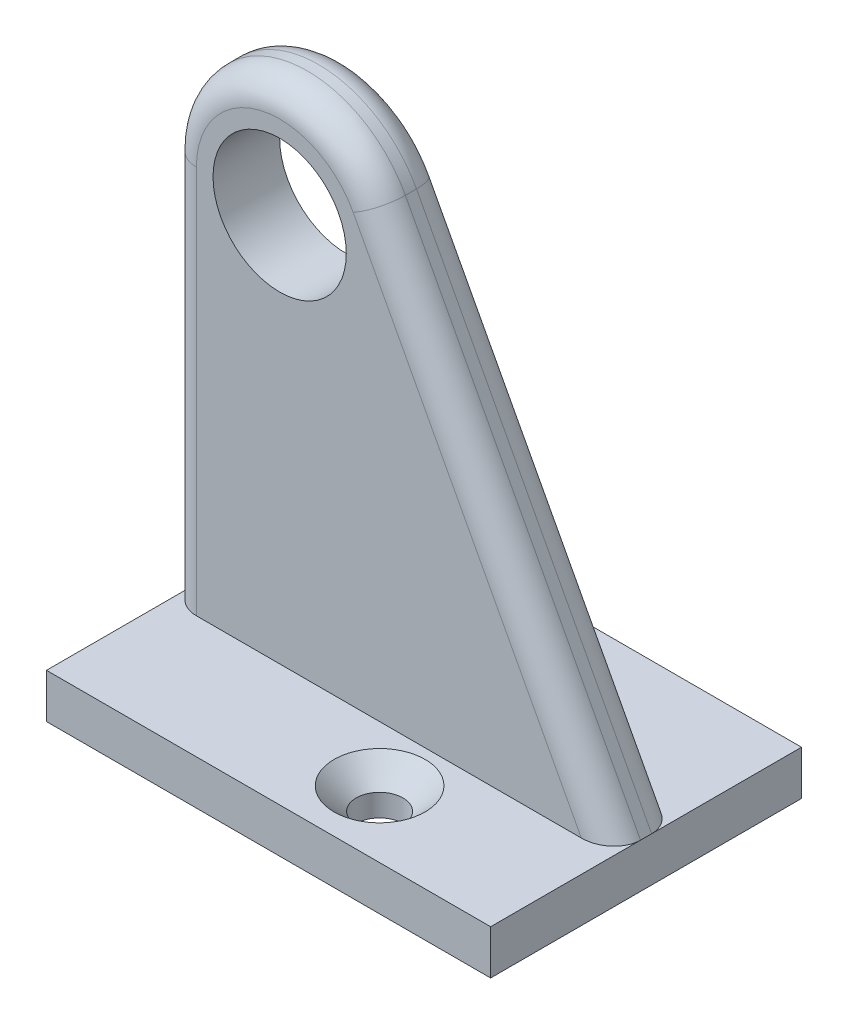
ISO-10303-21;
HEADER;
FILE_DESCRIPTION(('STEP AP214'),'2;1');
FILE_NAME('part.step','',(''),(''),'','','');
FILE_SCHEMA(('AUTOMOTIVE_DESIGN { 1 0 10303 214 1 1 1 1 }'));
ENDSEC;
DATA;
#1=APPLICATION_CONTEXT('core data for automotive mechanical design processes');
#2=APPLICATION_PROTOCOL_DEFINITION('international standard','automotive_design',2000,#1);
#3=PRODUCT_CONTEXT('',#1,'mechanical');
#4=PRODUCT('Part','Part','',(#3));
#5=PRODUCT_RELATED_PRODUCT_CATEGORY('part','',(#4));
#6=PRODUCT_DEFINITION_FORMATION('','',#4);
#7=PRODUCT_DEFINITION_CONTEXT('part definition',#1,'design');
#8=PRODUCT_DEFINITION('design','',#6,#7);
#9=PRODUCT_DEFINITION_SHAPE('','',#8);
#10=(LENGTH_UNIT() NAMED_UNIT(*) SI_UNIT(.MILLI.,.METRE.));
#11=(NAMED_UNIT(*) PLANE_ANGLE_UNIT() SI_UNIT($,.RADIAN.));
#12=(NAMED_UNIT(*) SI_UNIT($,.STERADIAN.) SOLID_ANGLE_UNIT());
#13=UNCERTAINTY_MEASURE_WITH_UNIT(LENGTH_MEASURE(1.E-05),#10,'distance_accuracy_value','');
#14=(GEOMETRIC_REPRESENTATION_CONTEXT(3) GLOBAL_UNCERTAINTY_ASSIGNED_CONTEXT((#13)) GLOBAL_UNIT_ASSIGNED_CONTEXT((#10,
#11,#12)) REPRESENTATION_CONTEXT('',''));
#15=CARTESIAN_POINT('',(0.,0.,0.));
#16=DIRECTION('',(0.,0.,1.));
#17=DIRECTION('',(1.,0.,0.));
#18=AXIS2_PLACEMENT_3D('',#15,#16,#17);
#19=CARTESIAN_POINT('',(-10.,35.,-3.));
#20=DIRECTION('',(0.,0.,1.));
#21=DIRECTION('',(1.,0.,0.));
#22=AXIS2_PLACEMENT_3D('',#19,#20,#21);
#23=PLANE('',#22);
#24=CARTESIAN_POINT('',(-10.,35.,-3.));
#25=DIRECTION('',(0.,0.,-1.));
#26=DIRECTION('',(-1.,0.,0.));
#27=AXIS2_PLACEMENT_3D('',#24,#25,#26);
#28=CIRCLE('',#27,5.99999999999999);
#29=CARTESIAN_POINT('',(-16.,35.,-3.));
#30=VERTEX_POINT('',#29);
#31=EDGE_CURVE('E193',#30,#30,#28,.T.);
#32=ORIENTED_EDGE('',*,*,#31,.F.);
#33=EDGE_LOOP('',(#32));
#34=FACE_BOUND('',#33,.T.);
#35=DIRECTION('',(1.,0.,0.));
#36=VECTOR('',#35,1.);
#37=CARTESIAN_POINT('',(20.,0.,-3.));
#38=LINE('',#37,#36);
#39=CARTESIAN_POINT('',(-17.5,0.,-3.));
#40=VERTEX_POINT('',#39);
#41=CARTESIAN_POINT('',(17.1666666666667,0.,-3.));
#42=VERTEX_POINT('',#41);
#43=EDGE_CURVE('E147',#40,#42,#38,.T.);
#44=ORIENTED_EDGE('',*,*,#43,.F.);
#45=DIRECTION('',(0.,-1.,0.));
#46=VECTOR('',#45,1.);
#47=CARTESIAN_POINT('',(-17.5,35.,-3.));
#48=LINE('',#47,#46);
#49=CARTESIAN_POINT('',(-17.5,35.,-3.));
#50=VERTEX_POINT('',#49);
#51=EDGE_CURVE('E200',#40,#50,#48,.F.);
#52=ORIENTED_EDGE('',*,*,#51,.T.);
#53=CARTESIAN_POINT('',(-10.,35.,-3.));
#54=DIRECTION('',(0.,0.,1.));
#55=DIRECTION('',(1.,0.,0.));
#56=AXIS2_PLACEMENT_3D('',#53,#54,#55);
#57=CIRCLE('',#56,7.5);
#58=CARTESIAN_POINT('',(-3.38235294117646,38.5294117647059,-3.));
#59=VERTEX_POINT('',#58);
#60=EDGE_CURVE('E198',#50,#59,#57,.F.);
#61=ORIENTED_EDGE('',*,*,#60,.T.);
#62=DIRECTION('',(-0.470588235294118,0.882352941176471,0.));
#63=VECTOR('',#62,1.);
#64=CARTESIAN_POINT('',(17.7941176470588,-1.17647058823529,-3.));
#65=LINE('',#64,#63);
#66=EDGE_CURVE('E196',#59,#42,#65,.F.);
#67=ORIENTED_EDGE('',*,*,#66,.T.);
#68=EDGE_LOOP('',(#44,#52,#61,#67));
#69=FACE_BOUND('',#68,.T.);
#70=ADVANCED_FACE('F35',(#34,#69),#23,.F.);
#71=CARTESIAN_POINT('',(-10.,35.,-3.));
#72=DIRECTION('',(0.,0.,1.));
#73=DIRECTION('',(1.,0.,0.));
#74=AXIS2_PLACEMENT_3D('',#71,#72,#73);
#75=CYLINDRICAL_SURFACE('',#74,10.);
#76=DIRECTION('',(0.,0.,1.));
#77=VECTOR('',#76,1.);
#78=CARTESIAN_POINT('',(-1.17647058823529,39.7058823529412,-3.));
#79=LINE('',#78,#77);
#80=CARTESIAN_POINT('',(-1.17647058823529,39.7058823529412,-0.499999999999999));
#81=VERTEX_POINT('',#80);
#82=CARTESIAN_POINT('',(-1.17647058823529,39.7058823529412,0.5));
#83=VERTEX_POINT('',#82);
#84=EDGE_CURVE('E177',#81,#83,#79,.T.);
#85=ORIENTED_EDGE('',*,*,#84,.F.);
#86=CARTESIAN_POINT('',(-10.,35.,-0.499999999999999));
#87=DIRECTION('',(0.,0.,1.));
#88=DIRECTION('',(1.,0.,0.));
#89=AXIS2_PLACEMENT_3D('',#86,#87,#88);
#90=CIRCLE('',#89,10.);
#91=CARTESIAN_POINT('',(-20.,35.,-0.499999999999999));
#92=VERTEX_POINT('',#91);
#93=EDGE_CURVE('E204',#81,#92,#90,.T.);
#94=ORIENTED_EDGE('',*,*,#93,.T.);
#95=DIRECTION('',(0.,0.,1.));
#96=VECTOR('',#95,1.);
#97=CARTESIAN_POINT('',(-20.,35.,-3.));
#98=LINE('',#97,#96);
#99=CARTESIAN_POINT('',(-20.,35.,0.5));
#100=VERTEX_POINT('',#99);
#101=EDGE_CURVE('E176',#92,#100,#98,.T.);
#102=ORIENTED_EDGE('',*,*,#101,.T.);
#103=CARTESIAN_POINT('',(-10.,35.,0.5));
#104=DIRECTION('',(0.,0.,1.));
#105=DIRECTION('',(1.,0.,0.));
#106=AXIS2_PLACEMENT_3D('',#103,#104,#105);
#107=CIRCLE('',#106,10.);
#108=EDGE_CURVE('E202',#100,#83,#107,.F.);
#109=ORIENTED_EDGE('',*,*,#108,.T.);
#110=EDGE_LOOP('',(#85,#94,#102,#109));
#111=FACE_BOUND('',#110,.T.);
#112=ADVANCED_FACE('F258',(#111),#75,.T.);
#113=CARTESIAN_POINT('',(20.,0.,-3.));
#114=DIRECTION('',(0.882352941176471,0.470588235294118,0.));
#115=DIRECTION('',(-0.470588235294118,0.882352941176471,0.));
#116=AXIS2_PLACEMENT_3D('',#113,#114,#115);
#117=PLANE('',#116);
#118=DIRECTION('',(0.,0.,1.));
#119=VECTOR('',#118,1.);
#120=CARTESIAN_POINT('',(20.,0.,-3.));
#121=LINE('',#120,#119);
#122=CARTESIAN_POINT('',(20.,0.,-0.499999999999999));
#123=VERTEX_POINT('',#122);
#124=CARTESIAN_POINT('',(20.,0.,0.5));
#125=VERTEX_POINT('',#124);
#126=EDGE_CURVE('E182',#123,#125,#121,.T.);
#127=ORIENTED_EDGE('',*,*,#126,.F.);
#128=DIRECTION('',(-0.470588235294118,0.882352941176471,0.));
#129=VECTOR('',#128,1.);
#130=CARTESIAN_POINT('',(-1.17647058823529,39.7058823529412,-0.499999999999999));
#131=LINE('',#130,#129);
#132=EDGE_CURVE('E209',#123,#81,#131,.T.);
#133=ORIENTED_EDGE('',*,*,#132,.T.);
#134=ORIENTED_EDGE('',*,*,#84,.T.);
#135=DIRECTION('',(-0.470588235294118,0.882352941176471,0.));
#136=VECTOR('',#135,1.);
#137=CARTESIAN_POINT('',(20.,0.,0.5));
#138=LINE('',#137,#136);
#139=EDGE_CURVE('E206',#83,#125,#138,.F.);
#140=ORIENTED_EDGE('',*,*,#139,.T.);
#141=EDGE_LOOP('',(#127,#133,#134,#140));
#142=FACE_BOUND('',#141,.T.);
#143=ADVANCED_FACE('F245',(#142),#117,.T.);
#144=CARTESIAN_POINT('',(20.,-4.,-3.));
#145=DIRECTION('',(1.,0.,0.));
#146=DIRECTION('',(0.,0.,-1.));
#147=AXIS2_PLACEMENT_3D('',#144,#145,#146);
#148=PLANE('',#147);
#149=CARTESIAN_POINT('',(20.,0.,-14.));
#150=VERTEX_POINT('',#149);
#151=EDGE_CURVE('E134',#150,#123,#121,.T.);
#152=ORIENTED_EDGE('',*,*,#151,.T.);
#153=ORIENTED_EDGE('',*,*,#126,.T.);
#154=DIRECTION('',(0.,0.,-1.));
#155=VECTOR('',#154,1.);
#156=CARTESIAN_POINT('',(20.,0.,14.));
#157=LINE('',#156,#155);
#158=CARTESIAN_POINT('',(20.,0.,14.));
#159=VERTEX_POINT('',#158);
#160=EDGE_CURVE('E174',#159,#125,#157,.T.);
#161=ORIENTED_EDGE('',*,*,#160,.F.);
#162=DIRECTION('',(0.,1.,0.));
#163=VECTOR('',#162,1.);
#164=CARTESIAN_POINT('',(20.,0.,14.));
#165=LINE('',#164,#163);
#166=CARTESIAN_POINT('',(20.,-4.,14.));
#167=VERTEX_POINT('',#166);
#168=EDGE_CURVE('E157',#167,#159,#165,.T.);
#169=ORIENTED_EDGE('',*,*,#168,.F.);
#170=DIRECTION('',(0.,0.,1.));
#171=VECTOR('',#170,1.);
#172=CARTESIAN_POINT('',(20.,-4.,-3.));
#173=LINE('',#172,#171);
#174=CARTESIAN_POINT('',(20.,-4.,-14.));
#175=VERTEX_POINT('',#174);
#176=EDGE_CURVE('E183',#175,#167,#173,.T.);
#177=ORIENTED_EDGE('',*,*,#176,.F.);
#178=DIRECTION('',(0.,-1.,0.));
#179=VECTOR('',#178,1.);
#180=CARTESIAN_POINT('',(20.,-4.,-14.));
#181=LINE('',#180,#179);
#182=EDGE_CURVE('E138',#150,#175,#181,.T.);
#183=ORIENTED_EDGE('',*,*,#182,.F.);
#184=EDGE_LOOP('',(#152,#153,#161,#169,#177,#183));
#185=FACE_BOUND('',#184,.T.);
#186=ADVANCED_FACE('F248',(#185),#148,.T.);
#187=CARTESIAN_POINT('',(-20.,-4.,-3.));
#188=DIRECTION('',(0.,-1.,0.));
#189=DIRECTION('',(0.,0.,-1.));
#190=AXIS2_PLACEMENT_3D('',#187,#188,#189);
#191=PLANE('',#190);
#192=CARTESIAN_POINT('',(-14.,-4.,-8.));
#193=DIRECTION('',(0.,1.,0.));
#194=DIRECTION('',(0.,0.,1.));
#195=AXIS2_PLACEMENT_3D('',#192,#193,#194);
#196=CIRCLE('',#195,2.1);
#197=CARTESIAN_POINT('',(-14.,-4.,-5.9));
#198=VERTEX_POINT('',#197);
#199=EDGE_CURVE('E499',#198,#198,#196,.T.);
#200=ORIENTED_EDGE('',*,*,#199,.T.);
#201=EDGE_LOOP('',(#200));
#202=FACE_BOUND('',#201,.T.);
#203=CARTESIAN_POINT('',(3.99999999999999,-4.,8.));
#204=DIRECTION('',(0.,1.,0.));
#205=DIRECTION('',(0.,0.,1.));
#206=AXIS2_PLACEMENT_3D('',#203,#204,#205);
#207=CIRCLE('',#206,2.1);
#208=CARTESIAN_POINT('',(3.99999999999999,-4.,10.1));
#209=VERTEX_POINT('',#208);
#210=EDGE_CURVE('E269',#209,#209,#207,.T.);
#211=ORIENTED_EDGE('',*,*,#210,.T.);
#212=EDGE_LOOP('',(#211));
#213=FACE_BOUND('',#212,.T.);
#214=ORIENTED_EDGE('',*,*,#176,.T.);
#215=DIRECTION('',(1.,0.,0.));
#216=VECTOR('',#215,1.);
#217=CARTESIAN_POINT('',(20.,-4.,14.));
#218=LINE('',#217,#216);
#219=CARTESIAN_POINT('',(-20.,-4.,14.));
#220=VERTEX_POINT('',#219);
#221=EDGE_CURVE('E169',#220,#167,#218,.T.);
#222=ORIENTED_EDGE('',*,*,#221,.F.);
#223=DIRECTION('',(0.,0.,1.));
#224=VECTOR('',#223,1.);
#225=CARTESIAN_POINT('',(-20.,-4.,-3.));
#226=LINE('',#225,#224);
#227=CARTESIAN_POINT('',(-20.,-4.,-14.));
#228=VERTEX_POINT('',#227);
#229=EDGE_CURVE('E185',#228,#220,#226,.T.);
#230=ORIENTED_EDGE('',*,*,#229,.F.);
#231=DIRECTION('',(-1.,0.,0.));
#232=VECTOR('',#231,1.);
#233=CARTESIAN_POINT('',(-20.,-4.,-14.));
#234=LINE('',#233,#232);
#235=EDGE_CURVE('E145',#175,#228,#234,.T.);
#236=ORIENTED_EDGE('',*,*,#235,.F.);
#237=EDGE_LOOP('',(#214,#222,#230,#236));
#238=FACE_BOUND('',#237,.T.);
#239=ADVANCED_FACE('F281',(#202,#213,#238),#191,.T.);
#240=CARTESIAN_POINT('',(-20.,35.,-3.));
#241=DIRECTION('',(-1.,0.,0.));
#242=DIRECTION('',(0.,0.,1.));
#243=AXIS2_PLACEMENT_3D('',#240,#241,#242);
#244=PLANE('',#243);
#245=ORIENTED_EDGE('',*,*,#101,.F.);
#246=DIRECTION('',(0.,-1.,0.));
#247=VECTOR('',#246,1.);
#248=CARTESIAN_POINT('',(-20.,0.,-0.499999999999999));
#249=LINE('',#248,#247);
#250=CARTESIAN_POINT('',(-20.,0.,-0.499999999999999));
#251=VERTEX_POINT('',#250);
#252=EDGE_CURVE('E153',#92,#251,#249,.T.);
#253=ORIENTED_EDGE('',*,*,#252,.T.);
#254=DIRECTION('',(0.,0.,1.));
#255=VECTOR('',#254,1.);
#256=CARTESIAN_POINT('',(-20.,0.,-14.));
#257=LINE('',#256,#255);
#258=CARTESIAN_POINT('',(-20.,0.,-14.));
#259=VERTEX_POINT('',#258);
#260=EDGE_CURVE('E131',#259,#251,#257,.T.);
#261=ORIENTED_EDGE('',*,*,#260,.F.);
#262=DIRECTION('',(0.,1.,0.));
#263=VECTOR('',#262,1.);
#264=CARTESIAN_POINT('',(-20.,0.,-14.));
#265=LINE('',#264,#263);
#266=EDGE_CURVE('E139',#228,#259,#265,.T.);
#267=ORIENTED_EDGE('',*,*,#266,.F.);
#268=ORIENTED_EDGE('',*,*,#229,.T.);
#269=DIRECTION('',(0.,-1.,0.));
#270=VECTOR('',#269,1.);
#271=CARTESIAN_POINT('',(-20.,-4.,14.));
#272=LINE('',#271,#270);
#273=CARTESIAN_POINT('',(-20.,0.,14.));
#274=VERTEX_POINT('',#273);
#275=EDGE_CURVE('E166',#274,#220,#272,.T.);
#276=ORIENTED_EDGE('',*,*,#275,.F.);
#277=DIRECTION('',(0.,0.,-1.));
#278=VECTOR('',#277,1.);
#279=CARTESIAN_POINT('',(-20.,0.,14.));
#280=LINE('',#279,#278);
#281=CARTESIAN_POINT('',(-20.,0.,0.5));
#282=VERTEX_POINT('',#281);
#283=EDGE_CURVE('E171',#274,#282,#280,.T.);
#284=ORIENTED_EDGE('',*,*,#283,.T.);
#285=DIRECTION('',(0.,-1.,0.));
#286=VECTOR('',#285,1.);
#287=CARTESIAN_POINT('',(-20.,35.,0.5));
#288=LINE('',#287,#286);
#289=EDGE_CURVE('E180',#282,#100,#288,.F.);
#290=ORIENTED_EDGE('',*,*,#289,.T.);
#291=EDGE_LOOP('',(#245,#253,#261,#267,#268,#276,#284,#290));
#292=FACE_BOUND('',#291,.T.);
#293=ADVANCED_FACE('F151',(#292),#244,.T.);
#294=CARTESIAN_POINT('',(-10.,35.,3.));
#295=DIRECTION('',(0.,0.,1.));
#296=DIRECTION('',(1.,0.,0.));
#297=AXIS2_PLACEMENT_3D('',#294,#295,#296);
#298=PLANE('',#297);
#299=CARTESIAN_POINT('',(-10.,35.,3.));
#300=DIRECTION('',(0.,0.,1.));
#301=DIRECTION('',(1.,0.,0.));
#302=AXIS2_PLACEMENT_3D('',#299,#300,#301);
#303=CIRCLE('',#302,5.99999999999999);
#304=CARTESIAN_POINT('',(-4.00000000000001,35.,3.));
#305=VERTEX_POINT('',#304);
#306=EDGE_CURVE('E189',#305,#305,#303,.T.);
#307=ORIENTED_EDGE('',*,*,#306,.F.);
#308=EDGE_LOOP('',(#307));
#309=FACE_BOUND('',#308,.T.);
#310=DIRECTION('',(-1.,0.,0.));
#311=VECTOR('',#310,1.);
#312=CARTESIAN_POINT('',(-20.,0.,3.));
#313=LINE('',#312,#311);
#314=CARTESIAN_POINT('',(17.1666666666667,0.,3.));
#315=VERTEX_POINT('',#314);
#316=CARTESIAN_POINT('',(-17.5,0.,3.));
#317=VERTEX_POINT('',#316);
#318=EDGE_CURVE('E154',#315,#317,#313,.T.);
#319=ORIENTED_EDGE('',*,*,#318,.F.);
#320=DIRECTION('',(-0.470588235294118,0.882352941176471,0.));
#321=VECTOR('',#320,1.);
#322=CARTESIAN_POINT('',(-3.38235294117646,38.5294117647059,3.));
#323=LINE('',#322,#321);
#324=CARTESIAN_POINT('',(-3.38235294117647,38.5294117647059,3.));
#325=VERTEX_POINT('',#324);
#326=EDGE_CURVE('E214',#315,#325,#323,.T.);
#327=ORIENTED_EDGE('',*,*,#326,.T.);
#328=CARTESIAN_POINT('',(-10.,35.,3.));
#329=DIRECTION('',(0.,0.,1.));
#330=DIRECTION('',(1.,0.,0.));
#331=AXIS2_PLACEMENT_3D('',#328,#329,#330);
#332=CIRCLE('',#331,7.5);
#333=CARTESIAN_POINT('',(-17.5,35.,3.));
#334=VERTEX_POINT('',#333);
#335=EDGE_CURVE('E59',#325,#334,#332,.T.);
#336=ORIENTED_EDGE('',*,*,#335,.T.);
#337=DIRECTION('',(0.,-1.,0.));
#338=VECTOR('',#337,1.);
#339=CARTESIAN_POINT('',(-17.5,35.,3.));
#340=LINE('',#339,#338);
#341=EDGE_CURVE('E211',#334,#317,#340,.T.);
#342=ORIENTED_EDGE('',*,*,#341,.T.);
#343=EDGE_LOOP('',(#319,#327,#336,#342));
#344=FACE_BOUND('',#343,.T.);
#345=ADVANCED_FACE('F235',(#309,#344),#298,.T.);
#346=CARTESIAN_POINT('',(-20.,0.,14.));
#347=DIRECTION('',(0.,-1.,0.));
#348=DIRECTION('',(0.,0.,-1.));
#349=AXIS2_PLACEMENT_3D('',#346,#347,#348);
#350=PLANE('',#349);
#351=CARTESIAN_POINT('',(3.99999999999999,0.,8.));
#352=DIRECTION('',(0.,1.,0.));
#353=DIRECTION('',(0.,0.,1.));
#354=AXIS2_PLACEMENT_3D('',#351,#352,#353);
#355=CIRCLE('',#354,4.1);
#356=CARTESIAN_POINT('',(3.99999999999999,0.,12.1));
#357=VERTEX_POINT('',#356);
#358=EDGE_CURVE('E276',#357,#357,#355,.T.);
#359=ORIENTED_EDGE('',*,*,#358,.F.);
#360=EDGE_LOOP('',(#359));
#361=FACE_BOUND('',#360,.T.);
#362=ORIENTED_EDGE('',*,*,#160,.T.);
#363=CARTESIAN_POINT('',(17.1666666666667,0.,0.5));
#364=DIRECTION('',(0.,-1.,0.));
#365=DIRECTION('',(-1.,0.,0.));
#366=AXIS2_PLACEMENT_3D('',#363,#364,#365);
#367=ELLIPSE('',#366,2.83333333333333,2.5);
#368=EDGE_CURVE('E44',#125,#315,#367,.T.);
#369=ORIENTED_EDGE('',*,*,#368,.T.);
#370=ORIENTED_EDGE('',*,*,#318,.T.);
#371=CARTESIAN_POINT('',(-17.5,0.,0.5));
#372=DIRECTION('',(0.,-1.,0.));
#373=DIRECTION('',(0.,0.,-1.));
#374=AXIS2_PLACEMENT_3D('',#371,#372,#373);
#375=CIRCLE('',#374,2.5);
#376=EDGE_CURVE('E11',#317,#282,#375,.T.);
#377=ORIENTED_EDGE('',*,*,#376,.T.);
#378=ORIENTED_EDGE('',*,*,#283,.F.);
#379=DIRECTION('',(-1.,0.,0.));
#380=VECTOR('',#379,1.);
#381=CARTESIAN_POINT('',(-20.,0.,14.));
#382=LINE('',#381,#380);
#383=EDGE_CURVE('E164',#159,#274,#382,.T.);
#384=ORIENTED_EDGE('',*,*,#383,.F.);
#385=EDGE_LOOP('',(#362,#369,#370,#377,#378,#384));
#386=FACE_BOUND('',#385,.T.);
#387=ADVANCED_FACE('F237',(#361,#386),#350,.F.);
#388=CARTESIAN_POINT('',(0.,0.,14.));
#389=DIRECTION('',(0.,0.,-1.));
#390=DIRECTION('',(-1.,0.,0.));
#391=AXIS2_PLACEMENT_3D('',#388,#389,#390);
#392=PLANE('',#391);
#393=ORIENTED_EDGE('',*,*,#168,.T.);
#394=ORIENTED_EDGE('',*,*,#383,.T.);
#395=ORIENTED_EDGE('',*,*,#275,.T.);
#396=ORIENTED_EDGE('',*,*,#221,.T.);
#397=EDGE_LOOP('',(#393,#394,#395,#396));
#398=FACE_BOUND('',#397,.T.);
#399=ADVANCED_FACE('F285',(#398),#392,.F.);
#400=CARTESIAN_POINT('',(20.,0.,-14.));
#401=DIRECTION('',(0.,-1.,0.));
#402=DIRECTION('',(0.,0.,-1.));
#403=AXIS2_PLACEMENT_3D('',#400,#401,#402);
#404=PLANE('',#403);
#405=CARTESIAN_POINT('',(-14.,0.,-8.));
#406=DIRECTION('',(0.,1.,0.));
#407=DIRECTION('',(0.,0.,1.));
#408=AXIS2_PLACEMENT_3D('',#405,#406,#407);
#409=CIRCLE('',#408,4.1);
#410=CARTESIAN_POINT('',(-14.,0.,-3.9));
#411=VERTEX_POINT('',#410);
#412=EDGE_CURVE('E192',#411,#411,#409,.T.);
#413=ORIENTED_EDGE('',*,*,#412,.F.);
#414=EDGE_LOOP('',(#413));
#415=FACE_BOUND('',#414,.T.);
#416=ORIENTED_EDGE('',*,*,#260,.T.);
#417=CARTESIAN_POINT('',(-17.5,0.,-0.499999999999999));
#418=DIRECTION('',(0.,-1.,0.));
#419=DIRECTION('',(0.,0.,-1.));
#420=AXIS2_PLACEMENT_3D('',#417,#418,#419);
#421=CIRCLE('',#420,2.5);
#422=EDGE_CURVE('E216',#251,#40,#421,.T.);
#423=ORIENTED_EDGE('',*,*,#422,.T.);
#424=ORIENTED_EDGE('',*,*,#43,.T.);
#425=CARTESIAN_POINT('',(17.1666666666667,0.,-0.499999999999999));
#426=DIRECTION('',(0.,-1.,0.));
#427=DIRECTION('',(1.,0.,0.));
#428=AXIS2_PLACEMENT_3D('',#425,#426,#427);
#429=ELLIPSE('',#428,2.83333333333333,2.5);
#430=EDGE_CURVE('E218',#42,#123,#429,.T.);
#431=ORIENTED_EDGE('',*,*,#430,.T.);
#432=ORIENTED_EDGE('',*,*,#151,.F.);
#433=DIRECTION('',(1.,0.,0.));
#434=VECTOR('',#433,1.);
#435=CARTESIAN_POINT('',(20.,0.,-14.));
#436=LINE('',#435,#434);
#437=EDGE_CURVE('E127',#259,#150,#436,.T.);
#438=ORIENTED_EDGE('',*,*,#437,.F.);
#439=EDGE_LOOP('',(#416,#423,#424,#431,#432,#438));
#440=FACE_BOUND('',#439,.T.);
#441=ADVANCED_FACE('F129',(#415,#440),#404,.F.);
#442=CARTESIAN_POINT('',(0.,0.,-14.));
#443=DIRECTION('',(0.,0.,1.));
#444=DIRECTION('',(1.,0.,0.));
#445=AXIS2_PLACEMENT_3D('',#442,#443,#444);
#446=PLANE('',#445);
#447=ORIENTED_EDGE('',*,*,#266,.T.);
#448=ORIENTED_EDGE('',*,*,#437,.T.);
#449=ORIENTED_EDGE('',*,*,#182,.T.);
#450=ORIENTED_EDGE('',*,*,#235,.T.);
#451=EDGE_LOOP('',(#447,#448,#449,#450));
#452=FACE_BOUND('',#451,.T.);
#453=ADVANCED_FACE('F143',(#452),#446,.F.);
#454=CARTESIAN_POINT('',(3.99999999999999,0.,8.));
#455=DIRECTION('',(0.,1.,0.));
#456=DIRECTION('',(0.,0.,1.));
#457=AXIS2_PLACEMENT_3D('',#454,#455,#456);
#458=CYLINDRICAL_SURFACE('',#457,2.1);
#459=ORIENTED_EDGE('',*,*,#210,.F.);
#460=EDGE_LOOP('',(#459));
#461=FACE_BOUND('',#460,.T.);
#462=CARTESIAN_POINT('',(3.99999999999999,-2.,8.));
#463=DIRECTION('',(0.,1.,0.));
#464=DIRECTION('',(0.,0.,1.));
#465=AXIS2_PLACEMENT_3D('',#462,#463,#464);
#466=CIRCLE('',#465,2.1);
#467=CARTESIAN_POINT('',(3.99999999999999,-2.,10.1));
#468=VERTEX_POINT('',#467);
#469=EDGE_CURVE('E271',#468,#468,#466,.T.);
#470=ORIENTED_EDGE('',*,*,#469,.T.);
#471=EDGE_LOOP('',(#470));
#472=FACE_BOUND('',#471,.T.);
#473=ADVANCED_FACE('F374',(#461,#472),#458,.F.);
#474=CARTESIAN_POINT('',(3.99999999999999,0.,8.));
#475=DIRECTION('',(0.,1.,0.));
#476=DIRECTION('',(0.,0.,1.));
#477=AXIS2_PLACEMENT_3D('',#474,#475,#476);
#478=CONICAL_SURFACE('',#477,4.1,0.785398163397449);
#479=ORIENTED_EDGE('',*,*,#469,.F.);
#480=EDGE_LOOP('',(#479));
#481=FACE_BOUND('',#480,.T.);
#482=ORIENTED_EDGE('',*,*,#358,.T.);
#483=EDGE_LOOP('',(#482));
#484=FACE_BOUND('',#483,.T.);
#485=ADVANCED_FACE('F366',(#481,#484),#478,.F.);
#486=CARTESIAN_POINT('',(-14.,0.,-8.));
#487=DIRECTION('',(0.,1.,0.));
#488=DIRECTION('',(0.,0.,1.));
#489=AXIS2_PLACEMENT_3D('',#486,#487,#488);
#490=CYLINDRICAL_SURFACE('',#489,2.1);
#491=ORIENTED_EDGE('',*,*,#199,.F.);
#492=EDGE_LOOP('',(#491));
#493=FACE_BOUND('',#492,.T.);
#494=CARTESIAN_POINT('',(-14.,-2.,-8.));
#495=DIRECTION('',(0.,1.,0.));
#496=DIRECTION('',(0.,0.,1.));
#497=AXIS2_PLACEMENT_3D('',#494,#495,#496);
#498=CIRCLE('',#497,2.1);
#499=CARTESIAN_POINT('',(-14.,-2.,-5.9));
#500=VERTEX_POINT('',#499);
#501=EDGE_CURVE('E501',#500,#500,#498,.T.);
#502=ORIENTED_EDGE('',*,*,#501,.T.);
#503=EDGE_LOOP('',(#502));
#504=FACE_BOUND('',#503,.T.);
#505=ADVANCED_FACE('F358',(#493,#504),#490,.F.);
#506=CARTESIAN_POINT('',(-14.,0.,-8.));
#507=DIRECTION('',(0.,1.,0.));
#508=DIRECTION('',(0.,0.,1.));
#509=AXIS2_PLACEMENT_3D('',#506,#507,#508);
#510=CONICAL_SURFACE('',#509,4.1,0.785398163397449);
#511=ORIENTED_EDGE('',*,*,#501,.F.);
#512=EDGE_LOOP('',(#511));
#513=FACE_BOUND('',#512,.T.);
#514=ORIENTED_EDGE('',*,*,#412,.T.);
#515=EDGE_LOOP('',(#514));
#516=FACE_BOUND('',#515,.T.);
#517=ADVANCED_FACE('F350',(#513,#516),#510,.F.);
#518=CARTESIAN_POINT('',(-10.,35.,-3.));
#519=DIRECTION('',(0.,0.,-1.));
#520=DIRECTION('',(-1.,0.,0.));
#521=AXIS2_PLACEMENT_3D('',#518,#519,#520);
#522=CYLINDRICAL_SURFACE('',#521,5.99999999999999);
#523=ORIENTED_EDGE('',*,*,#306,.T.);
#524=EDGE_LOOP('',(#523));
#525=FACE_BOUND('',#524,.T.);
#526=ORIENTED_EDGE('',*,*,#31,.T.);
#527=EDGE_LOOP('',(#526));
#528=FACE_BOUND('',#527,.T.);
#529=ADVANCED_FACE('F323',(#525,#528),#522,.F.);
#530=CARTESIAN_POINT('',(17.7941176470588,-1.17647058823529,-0.499999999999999));
#531=DIRECTION('',(0.470588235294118,-0.882352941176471,0.));
#532=DIRECTION('',(0.882352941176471,0.470588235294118,0.));
#533=AXIS2_PLACEMENT_3D('',#530,#531,#532);
#534=CYLINDRICAL_SURFACE('',#533,2.5);
#535=ORIENTED_EDGE('',*,*,#430,.F.);
#536=ORIENTED_EDGE('',*,*,#66,.F.);
#537=CARTESIAN_POINT('',(-3.38235294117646,38.5294117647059,-0.499999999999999));
#538=DIRECTION('',(-0.470588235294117,0.882352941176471,0.));
#539=DIRECTION('',(-0.882352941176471,-0.470588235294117,0.));
#540=AXIS2_PLACEMENT_3D('',#537,#538,#539);
#541=CIRCLE('',#540,2.5);
#542=EDGE_CURVE('E224',#81,#59,#541,.T.);
#543=ORIENTED_EDGE('',*,*,#542,.F.);
#544=ORIENTED_EDGE('',*,*,#132,.F.);
#545=EDGE_LOOP('',(#535,#536,#543,#544));
#546=FACE_BOUND('',#545,.T.);
#547=ADVANCED_FACE('F254',(#546),#534,.T.);
#548=CARTESIAN_POINT('',(-10.,35.,-0.499999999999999));
#549=DIRECTION('',(0.,0.,1.));
#550=DIRECTION('',(1.,0.,0.));
#551=AXIS2_PLACEMENT_3D('',#548,#549,#550);
#552=TOROIDAL_SURFACE('',#551,7.5,2.5);
#553=ORIENTED_EDGE('',*,*,#542,.T.);
#554=ORIENTED_EDGE('',*,*,#60,.F.);
#555=CARTESIAN_POINT('',(-17.5,35.,-0.499999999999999));
#556=DIRECTION('',(0.,-1.,0.));
#557=DIRECTION('',(0.,0.,-1.));
#558=AXIS2_PLACEMENT_3D('',#555,#556,#557);
#559=CIRCLE('',#558,2.5);
#560=EDGE_CURVE('E221',#92,#50,#559,.T.);
#561=ORIENTED_EDGE('',*,*,#560,.F.);
#562=ORIENTED_EDGE('',*,*,#93,.F.);
#563=EDGE_LOOP('',(#553,#554,#561,#562));
#564=FACE_BOUND('',#563,.T.);
#565=ADVANCED_FACE('F262',(#564),#552,.T.);
#566=CARTESIAN_POINT('',(-17.5,35.,-0.499999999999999));
#567=DIRECTION('',(0.,1.,0.));
#568=DIRECTION('',(0.,0.,1.));
#569=AXIS2_PLACEMENT_3D('',#566,#567,#568);
#570=CYLINDRICAL_SURFACE('',#569,2.5);
#571=ORIENTED_EDGE('',*,*,#560,.T.);
#572=ORIENTED_EDGE('',*,*,#51,.F.);
#573=ORIENTED_EDGE('',*,*,#422,.F.);
#574=ORIENTED_EDGE('',*,*,#252,.F.);
#575=EDGE_LOOP('',(#571,#572,#573,#574));
#576=FACE_BOUND('',#575,.T.);
#577=ADVANCED_FACE('F265',(#576),#570,.T.);
#578=CARTESIAN_POINT('',(-17.5,35.,0.5));
#579=DIRECTION('',(0.,-1.,0.));
#580=DIRECTION('',(0.,0.,-1.));
#581=AXIS2_PLACEMENT_3D('',#578,#579,#580);
#582=CYLINDRICAL_SURFACE('',#581,2.5);
#583=ORIENTED_EDGE('',*,*,#376,.F.);
#584=ORIENTED_EDGE('',*,*,#341,.F.);
#585=CARTESIAN_POINT('',(-17.5,35.,0.5));
#586=DIRECTION('',(0.,1.,0.));
#587=DIRECTION('',(0.,0.,1.));
#588=AXIS2_PLACEMENT_3D('',#585,#586,#587);
#589=CIRCLE('',#588,2.5);
#590=EDGE_CURVE('E39',#100,#334,#589,.T.);
#591=ORIENTED_EDGE('',*,*,#590,.F.);
#592=ORIENTED_EDGE('',*,*,#289,.F.);
#593=EDGE_LOOP('',(#583,#584,#591,#592));
#594=FACE_BOUND('',#593,.T.);
#595=ADVANCED_FACE('F37',(#594),#582,.T.);
#596=CARTESIAN_POINT('',(-10.,35.,0.5));
#597=DIRECTION('',(0.,0.,1.));
#598=DIRECTION('',(1.,0.,0.));
#599=AXIS2_PLACEMENT_3D('',#596,#597,#598);
#600=TOROIDAL_SURFACE('',#599,7.5,2.5);
#601=ORIENTED_EDGE('',*,*,#590,.T.);
#602=ORIENTED_EDGE('',*,*,#335,.F.);
#603=CARTESIAN_POINT('',(-3.38235294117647,38.5294117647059,0.5));
#604=DIRECTION('',(0.470588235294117,-0.882352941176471,0.));
#605=DIRECTION('',(0.882352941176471,0.470588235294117,0.));
#606=AXIS2_PLACEMENT_3D('',#603,#604,#605);
#607=CIRCLE('',#606,2.5);
#608=EDGE_CURVE('E52',#83,#325,#607,.T.);
#609=ORIENTED_EDGE('',*,*,#608,.F.);
#610=ORIENTED_EDGE('',*,*,#108,.F.);
#611=EDGE_LOOP('',(#601,#602,#609,#610));
#612=FACE_BOUND('',#611,.T.);
#613=ADVANCED_FACE('F230',(#612),#600,.T.);
#614=CARTESIAN_POINT('',(-3.38235294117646,38.5294117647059,0.5));
#615=DIRECTION('',(-0.470588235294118,0.882352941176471,0.));
#616=DIRECTION('',(-0.882352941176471,-0.470588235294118,0.));
#617=AXIS2_PLACEMENT_3D('',#614,#615,#616);
#618=CYLINDRICAL_SURFACE('',#617,2.5);
#619=ORIENTED_EDGE('',*,*,#368,.F.);
#620=ORIENTED_EDGE('',*,*,#139,.F.);
#621=ORIENTED_EDGE('',*,*,#608,.T.);
#622=ORIENTED_EDGE('',*,*,#326,.F.);
#623=EDGE_LOOP('',(#619,#620,#621,#622));
#624=FACE_BOUND('',#623,.T.);
#625=ADVANCED_FACE('F241',(#624),#618,.T.);
#626=CLOSED_SHELL('',(#70,#112,#143,#186,#239,#293,#345,#387,#399,#441,#453,#473,#485,#505,#517,
#529,#547,#565,#577,#595,#613,#625));
#627=MANIFOLD_SOLID_BREP('B2',#626);
#628=ADVANCED_BREP_SHAPE_REPRESENTATION('',(#18,#627),#14);
#629=SHAPE_DEFINITION_REPRESENTATION(#9,#628);
ENDSEC;
END-ISO-10303-21;
